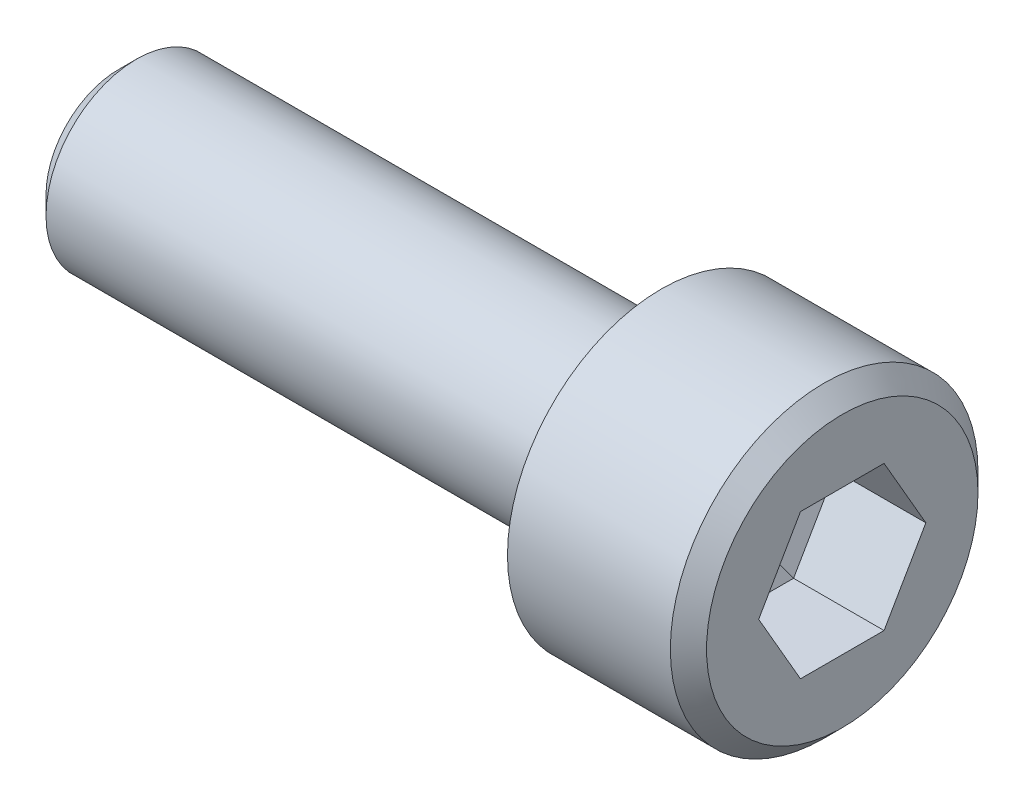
ISO-10303-21;
HEADER;
FILE_DESCRIPTION(('STEP AP214'),'2;1');
FILE_NAME('part.step','',(''),(''),'','','');
FILE_SCHEMA(('AUTOMOTIVE_DESIGN { 1 0 10303 214 1 1 1 1 }'));
ENDSEC;
DATA;
#1=APPLICATION_CONTEXT('core data for automotive mechanical design processes');
#2=APPLICATION_PROTOCOL_DEFINITION('international standard','automotive_design',2000,#1);
#3=PRODUCT_CONTEXT('',#1,'mechanical');
#4=PRODUCT('Part','Part','',(#3));
#5=PRODUCT_RELATED_PRODUCT_CATEGORY('part','',(#4));
#6=PRODUCT_DEFINITION_FORMATION('','',#4);
#7=PRODUCT_DEFINITION_CONTEXT('part definition',#1,'design');
#8=PRODUCT_DEFINITION('design','',#6,#7);
#9=PRODUCT_DEFINITION_SHAPE('','',#8);
#10=(LENGTH_UNIT() NAMED_UNIT(*) SI_UNIT(.MILLI.,.METRE.));
#11=(NAMED_UNIT(*) PLANE_ANGLE_UNIT() SI_UNIT($,.RADIAN.));
#12=(NAMED_UNIT(*) SI_UNIT($,.STERADIAN.) SOLID_ANGLE_UNIT());
#13=UNCERTAINTY_MEASURE_WITH_UNIT(LENGTH_MEASURE(1.E-05),#10,'distance_accuracy_value','');
#14=(GEOMETRIC_REPRESENTATION_CONTEXT(3) GLOBAL_UNCERTAINTY_ASSIGNED_CONTEXT((#13)) GLOBAL_UNIT_ASSIGNED_CONTEXT((#10,
#11,#12)) REPRESENTATION_CONTEXT('',''));
#15=CARTESIAN_POINT('',(0.,0.,0.));
#16=DIRECTION('',(0.,0.,1.));
#17=DIRECTION('',(1.,0.,0.));
#18=AXIS2_PLACEMENT_3D('',#15,#16,#17);
#19=CARTESIAN_POINT('',(-110.2,-53.85,-21.));
#20=DIRECTION('',(1.,0.,0.));
#21=DIRECTION('',(0.,0.,-1.));
#22=AXIS2_PLACEMENT_3D('',#19,#20,#21);
#23=PLANE('',#22);
#24=DIRECTION('',(0.,0.,-1.));
#25=VECTOR('',#24,1.);
#26=CARTESIAN_POINT('',(-110.2,-55.85,-19.8452994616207));
#27=LINE('',#26,#25);
#28=CARTESIAN_POINT('',(-110.2,-55.85,-19.8452994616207));
#29=VERTEX_POINT('',#28);
#30=CARTESIAN_POINT('',(-110.2,-55.85,-22.1547005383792));
#31=VERTEX_POINT('',#30);
#32=EDGE_CURVE('E301',#29,#31,#27,.T.);
#33=ORIENTED_EDGE('',*,*,#32,.F.);
#34=DIRECTION('',(0.,-0.866025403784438,-0.5));
#35=VECTOR('',#34,1.);
#36=CARTESIAN_POINT('',(-110.2,-53.85,-18.6905989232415));
#37=LINE('',#36,#35);
#38=CARTESIAN_POINT('',(-110.2,-53.85,-18.6905989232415));
#39=VERTEX_POINT('',#38);
#40=EDGE_CURVE('E88',#39,#29,#37,.T.);
#41=ORIENTED_EDGE('',*,*,#40,.F.);
#42=DIRECTION('',(0.,-0.866025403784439,0.5));
#43=VECTOR('',#42,1.);
#44=CARTESIAN_POINT('',(-110.2,-51.85,-19.8452994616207));
#45=LINE('',#44,#43);
#46=CARTESIAN_POINT('',(-110.2,-51.85,-19.8452994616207));
#47=VERTEX_POINT('',#46);
#48=EDGE_CURVE('E31',#47,#39,#45,.T.);
#49=ORIENTED_EDGE('',*,*,#48,.F.);
#50=DIRECTION('',(0.,0.,1.));
#51=VECTOR('',#50,1.);
#52=CARTESIAN_POINT('',(-110.2,-51.85,-22.1547005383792));
#53=LINE('',#52,#51);
#54=CARTESIAN_POINT('',(-110.2,-51.85,-22.1547005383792));
#55=VERTEX_POINT('',#54);
#56=EDGE_CURVE('E66',#55,#47,#53,.T.);
#57=ORIENTED_EDGE('',*,*,#56,.F.);
#58=DIRECTION('',(0.,0.866025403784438,0.5));
#59=VECTOR('',#58,1.);
#60=CARTESIAN_POINT('',(-110.2,-53.85,-23.3094010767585));
#61=LINE('',#60,#59);
#62=CARTESIAN_POINT('',(-110.2,-53.85,-23.3094010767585));
#63=VERTEX_POINT('',#62);
#64=EDGE_CURVE('E76',#63,#55,#61,.T.);
#65=ORIENTED_EDGE('',*,*,#64,.F.);
#66=DIRECTION('',(0.,0.86602540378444,-0.5));
#67=VECTOR('',#66,1.);
#68=CARTESIAN_POINT('',(-110.2,-55.85,-22.1547005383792));
#69=LINE('',#68,#67);
#70=EDGE_CURVE('E82',#31,#63,#69,.T.);
#71=ORIENTED_EDGE('',*,*,#70,.F.);
#72=EDGE_LOOP('',(#33,#41,#49,#57,#65,#71));
#73=FACE_BOUND('',#72,.T.);
#74=CARTESIAN_POINT('',(-110.2,-53.85,-21.));
#75=DIRECTION('',(1.,0.,0.));
#76=DIRECTION('',(0.,0.,-1.));
#77=AXIS2_PLACEMENT_3D('',#74,#75,#76);
#78=CIRCLE('',#77,3.75);
#79=CARTESIAN_POINT('',(-110.2,-53.85,-24.75));
#80=VERTEX_POINT('',#79);
#81=EDGE_CURVE('E110',#80,#80,#78,.T.);
#82=ORIENTED_EDGE('',*,*,#81,.T.);
#83=EDGE_LOOP('',(#82));
#84=FACE_BOUND('',#83,.T.);
#85=ADVANCED_FACE('F16',(#73,#84),#23,.T.);
#86=CARTESIAN_POINT('',(-115.2,-53.85,-21.));
#87=DIRECTION('',(-1.,0.,0.));
#88=DIRECTION('',(0.,0.,1.));
#89=AXIS2_PLACEMENT_3D('',#86,#87,#88);
#90=PLANE('',#89);
#91=CARTESIAN_POINT('',(-115.2,-53.85,-21.));
#92=DIRECTION('',(-1.,0.,0.));
#93=DIRECTION('',(0.,0.,1.));
#94=AXIS2_PLACEMENT_3D('',#91,#92,#93);
#95=CIRCLE('',#94,2.5);
#96=CARTESIAN_POINT('',(-115.2,-53.85,-18.5));
#97=VERTEX_POINT('',#96);
#98=EDGE_CURVE('E113',#97,#97,#95,.T.);
#99=ORIENTED_EDGE('',*,*,#98,.F.);
#100=EDGE_LOOP('',(#99));
#101=FACE_BOUND('',#100,.T.);
#102=CARTESIAN_POINT('',(-115.2,-53.85,-21.));
#103=DIRECTION('',(1.,0.,0.));
#104=DIRECTION('',(0.,0.,-1.));
#105=AXIS2_PLACEMENT_3D('',#102,#103,#104);
#106=CIRCLE('',#105,4.25);
#107=CARTESIAN_POINT('',(-115.2,-53.85,-25.25));
#108=VERTEX_POINT('',#107);
#109=EDGE_CURVE('E102',#108,#108,#106,.T.);
#110=ORIENTED_EDGE('',*,*,#109,.F.);
#111=EDGE_LOOP('',(#110));
#112=FACE_BOUND('',#111,.T.);
#113=ADVANCED_FACE('F133',(#101,#112),#90,.T.);
#114=CARTESIAN_POINT('',(-115.2,-53.85,-21.));
#115=DIRECTION('',(1.,0.,0.));
#116=DIRECTION('',(0.,0.,-1.));
#117=AXIS2_PLACEMENT_3D('',#114,#115,#116);
#118=CYLINDRICAL_SURFACE('',#117,4.25);
#119=CARTESIAN_POINT('',(-110.7,-53.85,-21.));
#120=DIRECTION('',(1.,0.,0.));
#121=DIRECTION('',(0.,0.,-1.));
#122=AXIS2_PLACEMENT_3D('',#119,#120,#121);
#123=CIRCLE('',#122,4.25);
#124=CARTESIAN_POINT('',(-110.7,-53.85,-25.25));
#125=VERTEX_POINT('',#124);
#126=EDGE_CURVE('E107',#125,#125,#123,.F.);
#127=ORIENTED_EDGE('',*,*,#126,.T.);
#128=EDGE_LOOP('',(#127));
#129=FACE_BOUND('',#128,.T.);
#130=ORIENTED_EDGE('',*,*,#109,.T.);
#131=EDGE_LOOP('',(#130));
#132=FACE_BOUND('',#131,.T.);
#133=ADVANCED_FACE('F138',(#129,#132),#118,.T.);
#134=CARTESIAN_POINT('',(-110.7,-53.85,-21.));
#135=DIRECTION('',(-1.,0.,0.));
#136=DIRECTION('',(0.,0.,1.));
#137=AXIS2_PLACEMENT_3D('',#134,#135,#136);
#138=CONICAL_SURFACE('',#137,4.25,0.785398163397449);
#139=ORIENTED_EDGE('',*,*,#81,.F.);
#140=EDGE_LOOP('',(#139));
#141=FACE_BOUND('',#140,.T.);
#142=ORIENTED_EDGE('',*,*,#126,.F.);
#143=EDGE_LOOP('',(#142));
#144=FACE_BOUND('',#143,.T.);
#145=ADVANCED_FACE('F144',(#141,#144),#138,.T.);
#146=CARTESIAN_POINT('',(-112.7,-55.85,-19.8452994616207));
#147=DIRECTION('',(0.,-1.,0.));
#148=DIRECTION('',(0.,0.,1.));
#149=AXIS2_PLACEMENT_3D('',#146,#147,#148);
#150=PLANE('',#149);
#151=ORIENTED_EDGE('',*,*,#32,.T.);
#152=DIRECTION('',(1.,0.,0.));
#153=VECTOR('',#152,1.);
#154=CARTESIAN_POINT('',(-112.7,-55.85,-22.1547005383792));
#155=LINE('',#154,#153);
#156=CARTESIAN_POINT('',(-112.7,-55.85,-22.1547005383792));
#157=VERTEX_POINT('',#156);
#158=EDGE_CURVE('E100',#157,#31,#155,.T.);
#159=ORIENTED_EDGE('',*,*,#158,.F.);
#160=DIRECTION('',(0.,0.,-1.));
#161=VECTOR('',#160,1.);
#162=CARTESIAN_POINT('',(-112.7,-55.85,-19.8452994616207));
#163=LINE('',#162,#161);
#164=CARTESIAN_POINT('',(-112.7,-55.85,-19.8452994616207));
#165=VERTEX_POINT('',#164);
#166=EDGE_CURVE('E94',#165,#157,#163,.T.);
#167=ORIENTED_EDGE('',*,*,#166,.F.);
#168=DIRECTION('',(1.,0.,0.));
#169=VECTOR('',#168,1.);
#170=CARTESIAN_POINT('',(-112.7,-55.85,-19.8452994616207));
#171=LINE('',#170,#169);
#172=EDGE_CURVE('E97',#165,#29,#171,.T.);
#173=ORIENTED_EDGE('',*,*,#172,.T.);
#174=EDGE_LOOP('',(#151,#159,#167,#173));
#175=FACE_BOUND('',#174,.T.);
#176=ADVANCED_FACE('F147',(#175),#150,.F.);
#177=CARTESIAN_POINT('',(-112.7,-55.85,-22.1547005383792));
#178=DIRECTION('',(0.,-0.5,-0.86602540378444));
#179=DIRECTION('',(0.,-0.86602540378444,0.5));
#180=AXIS2_PLACEMENT_3D('',#177,#178,#179);
#181=PLANE('',#180);
#182=ORIENTED_EDGE('',*,*,#70,.T.);
#183=DIRECTION('',(1.,0.,0.));
#184=VECTOR('',#183,1.);
#185=CARTESIAN_POINT('',(-112.7,-53.85,-23.3094010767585));
#186=LINE('',#185,#184);
#187=CARTESIAN_POINT('',(-112.7,-53.85,-23.3094010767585));
#188=VERTEX_POINT('',#187);
#189=EDGE_CURVE('E72',#188,#63,#186,.T.);
#190=ORIENTED_EDGE('',*,*,#189,.F.);
#191=DIRECTION('',(0.,0.86602540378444,-0.5));
#192=VECTOR('',#191,1.);
#193=CARTESIAN_POINT('',(-112.7,-55.85,-22.1547005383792));
#194=LINE('',#193,#192);
#195=EDGE_CURVE('E298',#157,#188,#194,.T.);
#196=ORIENTED_EDGE('',*,*,#195,.F.);
#197=ORIENTED_EDGE('',*,*,#158,.T.);
#198=EDGE_LOOP('',(#182,#190,#196,#197));
#199=FACE_BOUND('',#198,.T.);
#200=ADVANCED_FACE('F152',(#199),#181,.F.);
#201=CARTESIAN_POINT('',(-112.7,-53.85,-23.3094010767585));
#202=DIRECTION('',(0.,0.5,-0.866025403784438));
#203=DIRECTION('',(0.,-0.866025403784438,-0.5));
#204=AXIS2_PLACEMENT_3D('',#201,#202,#203);
#205=PLANE('',#204);
#206=ORIENTED_EDGE('',*,*,#64,.T.);
#207=DIRECTION('',(1.,0.,0.));
#208=VECTOR('',#207,1.);
#209=CARTESIAN_POINT('',(-112.7,-51.85,-22.1547005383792));
#210=LINE('',#209,#208);
#211=CARTESIAN_POINT('',(-112.7,-51.85,-22.1547005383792));
#212=VERTEX_POINT('',#211);
#213=EDGE_CURVE('E61',#212,#55,#210,.T.);
#214=ORIENTED_EDGE('',*,*,#213,.F.);
#215=DIRECTION('',(0.,0.866025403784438,0.5));
#216=VECTOR('',#215,1.);
#217=CARTESIAN_POINT('',(-112.7,-53.85,-23.3094010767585));
#218=LINE('',#217,#216);
#219=EDGE_CURVE('E304',#188,#212,#218,.T.);
#220=ORIENTED_EDGE('',*,*,#219,.F.);
#221=ORIENTED_EDGE('',*,*,#189,.T.);
#222=EDGE_LOOP('',(#206,#214,#220,#221));
#223=FACE_BOUND('',#222,.T.);
#224=ADVANCED_FACE('F77',(#223),#205,.F.);
#225=CARTESIAN_POINT('',(-112.7,-51.85,-22.1547005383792));
#226=DIRECTION('',(0.,1.,0.));
#227=DIRECTION('',(0.,0.,-1.));
#228=AXIS2_PLACEMENT_3D('',#225,#226,#227);
#229=PLANE('',#228);
#230=ORIENTED_EDGE('',*,*,#56,.T.);
#231=DIRECTION('',(1.,0.,0.));
#232=VECTOR('',#231,1.);
#233=CARTESIAN_POINT('',(-112.7,-51.85,-19.8452994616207));
#234=LINE('',#233,#232);
#235=CARTESIAN_POINT('',(-112.7,-51.85,-19.8452994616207));
#236=VERTEX_POINT('',#235);
#237=EDGE_CURVE('E73',#236,#47,#234,.T.);
#238=ORIENTED_EDGE('',*,*,#237,.F.);
#239=DIRECTION('',(0.,0.,1.));
#240=VECTOR('',#239,1.);
#241=CARTESIAN_POINT('',(-112.7,-51.85,-22.1547005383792));
#242=LINE('',#241,#240);
#243=EDGE_CURVE('E69',#212,#236,#242,.T.);
#244=ORIENTED_EDGE('',*,*,#243,.F.);
#245=ORIENTED_EDGE('',*,*,#213,.T.);
#246=EDGE_LOOP('',(#230,#238,#244,#245));
#247=FACE_BOUND('',#246,.T.);
#248=ADVANCED_FACE('F63',(#247),#229,.F.);
#249=CARTESIAN_POINT('',(-112.7,-51.85,-19.8452994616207));
#250=DIRECTION('',(0.,0.5,0.866025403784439));
#251=DIRECTION('',(0.,0.866025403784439,-0.5));
#252=AXIS2_PLACEMENT_3D('',#249,#250,#251);
#253=PLANE('',#252);
#254=ORIENTED_EDGE('',*,*,#48,.T.);
#255=DIRECTION('',(1.,0.,0.));
#256=VECTOR('',#255,1.);
#257=CARTESIAN_POINT('',(-112.7,-53.85,-18.6905989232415));
#258=LINE('',#257,#256);
#259=CARTESIAN_POINT('',(-112.7,-53.85,-18.6905989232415));
#260=VERTEX_POINT('',#259);
#261=EDGE_CURVE('E95',#260,#39,#258,.T.);
#262=ORIENTED_EDGE('',*,*,#261,.F.);
#263=DIRECTION('',(0.,-0.866025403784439,0.5));
#264=VECTOR('',#263,1.);
#265=CARTESIAN_POINT('',(-112.7,-51.85,-19.8452994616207));
#266=LINE('',#265,#264);
#267=EDGE_CURVE('E40',#236,#260,#266,.T.);
#268=ORIENTED_EDGE('',*,*,#267,.F.);
#269=ORIENTED_EDGE('',*,*,#237,.T.);
#270=EDGE_LOOP('',(#254,#262,#268,#269));
#271=FACE_BOUND('',#270,.T.);
#272=ADVANCED_FACE('F171',(#271),#253,.F.);
#273=CARTESIAN_POINT('',(-112.7,-53.85,-18.6905989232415));
#274=DIRECTION('',(0.,-0.5,0.866025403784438));
#275=DIRECTION('',(0.,0.866025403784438,0.5));
#276=AXIS2_PLACEMENT_3D('',#273,#274,#275);
#277=PLANE('',#276);
#278=ORIENTED_EDGE('',*,*,#40,.T.);
#279=ORIENTED_EDGE('',*,*,#172,.F.);
#280=DIRECTION('',(0.,-0.866025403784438,-0.5));
#281=VECTOR('',#280,1.);
#282=CARTESIAN_POINT('',(-112.7,-53.85,-18.6905989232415));
#283=LINE('',#282,#281);
#284=EDGE_CURVE('E104',#260,#165,#283,.T.);
#285=ORIENTED_EDGE('',*,*,#284,.F.);
#286=ORIENTED_EDGE('',*,*,#261,.T.);
#287=EDGE_LOOP('',(#278,#279,#285,#286));
#288=FACE_BOUND('',#287,.T.);
#289=ADVANCED_FACE('F174',(#288),#277,.F.);
#290=CARTESIAN_POINT('',(-112.7,-55.85,-19.8452994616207));
#291=DIRECTION('',(-0.866025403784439,-0.5,0.));
#292=DIRECTION('',(0.5,-0.866025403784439,0.));
#293=AXIS2_PLACEMENT_3D('',#290,#291,#292);
#294=PLANE('',#293);
#295=ORIENTED_EDGE('',*,*,#166,.T.);
#296=DIRECTION('',(0.447213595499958,-0.774596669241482,-0.447213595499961));
#297=VECTOR('',#296,1.);
#298=CARTESIAN_POINT('',(-113.161880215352,-55.05,-21.6928203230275));
#299=LINE('',#298,#297);
#300=CARTESIAN_POINT('',(-113.854700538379,-53.85,-21.));
#301=VERTEX_POINT('',#300);
#302=EDGE_CURVE('E291',#301,#157,#299,.T.);
#303=ORIENTED_EDGE('',*,*,#302,.F.);
#304=DIRECTION('',(0.447213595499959,-0.774596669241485,0.447213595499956));
#305=VECTOR('',#304,1.);
#306=CARTESIAN_POINT('',(-113.161880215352,-55.05,-20.3071796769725));
#307=LINE('',#306,#305);
#308=EDGE_CURVE('E294',#301,#165,#307,.T.);
#309=ORIENTED_EDGE('',*,*,#308,.T.);
#310=EDGE_LOOP('',(#295,#303,#309));
#311=FACE_BOUND('',#310,.T.);
#312=ADVANCED_FACE('F177',(#311),#294,.F.);
#313=CARTESIAN_POINT('',(-112.7,-55.85,-22.1547005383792));
#314=DIRECTION('',(-0.866025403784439,-0.25,-0.433012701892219));
#315=DIRECTION('',(-0.447213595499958,0.,0.894427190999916));
#316=AXIS2_PLACEMENT_3D('',#313,#314,#315);
#317=PLANE('',#316);
#318=ORIENTED_EDGE('',*,*,#195,.T.);
#319=DIRECTION('',(0.447213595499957,0.,-0.894427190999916));
#320=VECTOR('',#319,1.);
#321=CARTESIAN_POINT('',(-113.161880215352,-53.85,-22.3856406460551));
#322=LINE('',#321,#320);
#323=EDGE_CURVE('E324',#301,#188,#322,.T.);
#324=ORIENTED_EDGE('',*,*,#323,.F.);
#325=ORIENTED_EDGE('',*,*,#302,.T.);
#326=EDGE_LOOP('',(#318,#324,#325));
#327=FACE_BOUND('',#326,.T.);
#328=ADVANCED_FACE('F193',(#327),#317,.F.);
#329=CARTESIAN_POINT('',(-112.7,-53.85,-23.3094010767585));
#330=DIRECTION('',(-0.866025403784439,0.25,-0.433012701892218));
#331=DIRECTION('',(-0.447213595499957,0.,0.894427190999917));
#332=AXIS2_PLACEMENT_3D('',#329,#330,#331);
#333=PLANE('',#332);
#334=ORIENTED_EDGE('',*,*,#219,.T.);
#335=DIRECTION('',(0.447213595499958,0.774596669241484,-0.447213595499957));
#336=VECTOR('',#335,1.);
#337=CARTESIAN_POINT('',(-113.161880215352,-52.65,-21.6928203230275));
#338=LINE('',#337,#336);
#339=EDGE_CURVE('E325',#301,#212,#338,.T.);
#340=ORIENTED_EDGE('',*,*,#339,.F.);
#341=ORIENTED_EDGE('',*,*,#323,.T.);
#342=EDGE_LOOP('',(#334,#340,#341));
#343=FACE_BOUND('',#342,.T.);
#344=ADVANCED_FACE('F189',(#343),#333,.F.);
#345=CARTESIAN_POINT('',(-112.7,-51.85,-22.1547005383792));
#346=DIRECTION('',(-0.866025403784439,0.5,0.));
#347=DIRECTION('',(-0.5,-0.866025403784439,0.));
#348=AXIS2_PLACEMENT_3D('',#345,#346,#347);
#349=PLANE('',#348);
#350=ORIENTED_EDGE('',*,*,#243,.T.);
#351=DIRECTION('',(0.447213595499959,0.774596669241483,0.447213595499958));
#352=VECTOR('',#351,1.);
#353=CARTESIAN_POINT('',(-113.161880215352,-52.65,-20.3071796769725));
#354=LINE('',#353,#352);
#355=EDGE_CURVE('E318',#301,#236,#354,.T.);
#356=ORIENTED_EDGE('',*,*,#355,.F.);
#357=ORIENTED_EDGE('',*,*,#339,.T.);
#358=EDGE_LOOP('',(#350,#356,#357));
#359=FACE_BOUND('',#358,.T.);
#360=ADVANCED_FACE('F186',(#359),#349,.F.);
#361=CARTESIAN_POINT('',(-112.7,-51.85,-19.8452994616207));
#362=DIRECTION('',(-0.866025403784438,0.25,0.433012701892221));
#363=DIRECTION('',(0.447213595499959,0.,0.894427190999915));
#364=AXIS2_PLACEMENT_3D('',#361,#362,#363);
#365=PLANE('',#364);
#366=ORIENTED_EDGE('',*,*,#267,.T.);
#367=DIRECTION('',(0.447213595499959,0.,0.894427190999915));
#368=VECTOR('',#367,1.);
#369=CARTESIAN_POINT('',(-113.161880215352,-53.85,-19.6143593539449));
#370=LINE('',#369,#368);
#371=EDGE_CURVE('E331',#301,#260,#370,.T.);
#372=ORIENTED_EDGE('',*,*,#371,.F.);
#373=ORIENTED_EDGE('',*,*,#355,.T.);
#374=EDGE_LOOP('',(#366,#372,#373));
#375=FACE_BOUND('',#374,.T.);
#376=ADVANCED_FACE('F182',(#375),#365,.F.);
#377=CARTESIAN_POINT('',(-112.7,-53.85,-18.6905989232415));
#378=DIRECTION('',(-0.866025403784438,-0.25,0.43301270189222));
#379=DIRECTION('',(0.447213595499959,0.,0.894427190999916));
#380=AXIS2_PLACEMENT_3D('',#377,#378,#379);
#381=PLANE('',#380);
#382=ORIENTED_EDGE('',*,*,#284,.T.);
#383=ORIENTED_EDGE('',*,*,#308,.F.);
#384=ORIENTED_EDGE('',*,*,#371,.T.);
#385=EDGE_LOOP('',(#382,#383,#384));
#386=FACE_BOUND('',#385,.T.);
#387=ADVANCED_FACE('F179',(#386),#381,.F.);
#388=CARTESIAN_POINT('',(-135.2,-53.85,-21.));
#389=DIRECTION('',(1.,0.,0.));
#390=DIRECTION('',(0.,0.,-1.));
#391=AXIS2_PLACEMENT_3D('',#388,#389,#390);
#392=CYLINDRICAL_SURFACE('',#391,2.5);
#393=CARTESIAN_POINT('',(-129.7,-53.85,-21.));
#394=DIRECTION('',(-1.,0.,0.));
#395=DIRECTION('',(0.,0.,1.));
#396=AXIS2_PLACEMENT_3D('',#393,#394,#395);
#397=CIRCLE('',#396,2.5);
#398=CARTESIAN_POINT('',(-129.7,-53.85,-18.5));
#399=VERTEX_POINT('',#398);
#400=EDGE_CURVE('E20',#399,#399,#397,.F.);
#401=ORIENTED_EDGE('',*,*,#400,.T.);
#402=EDGE_LOOP('',(#401));
#403=FACE_BOUND('',#402,.T.);
#404=ORIENTED_EDGE('',*,*,#98,.T.);
#405=EDGE_LOOP('',(#404));
#406=FACE_BOUND('',#405,.T.);
#407=ADVANCED_FACE('F120',(#403,#406),#392,.T.);
#408=CARTESIAN_POINT('',(-130.2,-53.85,-21.));
#409=DIRECTION('',(-1.,0.,0.));
#410=DIRECTION('',(0.,0.,1.));
#411=AXIS2_PLACEMENT_3D('',#408,#409,#410);
#412=PLANE('',#411);
#413=CARTESIAN_POINT('',(-130.2,-53.85,-21.));
#414=DIRECTION('',(-1.,0.,0.));
#415=DIRECTION('',(0.,0.,1.));
#416=AXIS2_PLACEMENT_3D('',#413,#414,#415);
#417=CIRCLE('',#416,2.);
#418=CARTESIAN_POINT('',(-130.2,-53.85,-19.));
#419=VERTEX_POINT('',#418);
#420=EDGE_CURVE('E11',#419,#419,#417,.T.);
#421=ORIENTED_EDGE('',*,*,#420,.T.);
#422=EDGE_LOOP('',(#421));
#423=FACE_BOUND('',#422,.T.);
#424=ADVANCED_FACE('F18',(#423),#412,.T.);
#425=CARTESIAN_POINT('',(-129.7,-53.85,-21.));
#426=DIRECTION('',(1.,0.,0.));
#427=DIRECTION('',(0.,0.,-1.));
#428=AXIS2_PLACEMENT_3D('',#425,#426,#427);
#429=CONICAL_SURFACE('',#428,2.5,0.785398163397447);
#430=ORIENTED_EDGE('',*,*,#420,.F.);
#431=EDGE_LOOP('',(#430));
#432=FACE_BOUND('',#431,.T.);
#433=ORIENTED_EDGE('',*,*,#400,.F.);
#434=EDGE_LOOP('',(#433));
#435=FACE_BOUND('',#434,.T.);
#436=ADVANCED_FACE('F122',(#432,#435),#429,.T.);
#437=CLOSED_SHELL('',(#85,#113,#133,#145,#176,#200,#224,#248,#272,#289,#312,#328,#344,#360,#376,
#387,#407,#424,#436));
#438=MANIFOLD_SOLID_BREP('B1',#437);
#439=ADVANCED_BREP_SHAPE_REPRESENTATION('',(#18,#438),#14);
#440=SHAPE_DEFINITION_REPRESENTATION(#9,#439);
ENDSEC;
END-ISO-10303-21;
